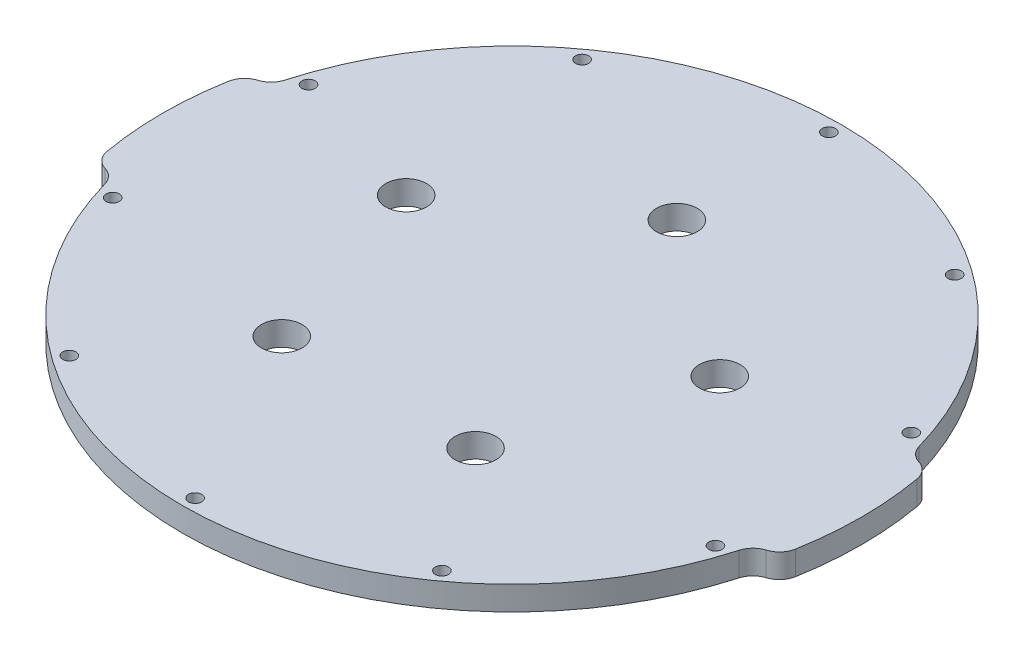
from build123d import *

# Parameters (mm, degrees)
SKETCH1_R           = 1.65
BOSS_EXTRUDE1_DEPTH = 6
FILLET1_R           = 5
SKETCH2_R           = 5.1
CUT_EXTRUDE1_DEPTH  = 121.480309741


with BuildPart() as part:
    # Sketch1 → Boss-Extrude1 (new body)
    with BuildSketch(Plane(origin=(0, 0, 0), x_dir=(1, 0, 0), z_dir=(0, 1, 0))):
        with BuildLine():
            ThreePointArc((-86.219918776, -15.202897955), (-87.55, 0), (-86.219918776, 15.202897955))
            ThreePointArc((-86.219918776, 15.202897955), (-84.101406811, 18.473379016), (-80.278914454, 19.23014285))
            ThreePointArc((-80.278914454, 19.23014285), (0, 82.55), (80.278914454, 19.23014285))
            ThreePointArc((80.278914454, 19.23014285), (84.101406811, 18.473379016), (86.219918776, 15.202897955))
            ThreePointArc((86.219918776, 15.202897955), (87.55, 0), (86.219918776, -15.202897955))
            ThreePointArc((86.219918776, -15.202897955), (84.101406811, -18.473379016), (80.278914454, -19.23014285))
            ThreePointArc((80.278914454, -19.23014285), (0, -82.55), (-80.278914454, -19.23014285))
            ThreePointArc((-80.278914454, -19.23014285), (-84.101406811, -18.473379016), (-86.219918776, -15.202897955))
        make_face()
        with Locations(Location((0, 79.35, 0), (0, 0, 270))):
            Circle(SKETCH1_R, mode=Mode.SUBTRACT)
        with Locations(Location((46.640759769, 64.195498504, 0), (0, 0, 270))):
            Circle(SKETCH1_R, mode=Mode.SUBTRACT)
        with Locations(Location((75.466334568, 24.520498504, 0), (0, 0, 270))):
            Circle(SKETCH1_R, mode=Mode.SUBTRACT)
        with Locations(Location((75.466334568, -24.520498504, 0), (0, 0, 270))):
            Circle(SKETCH1_R, mode=Mode.SUBTRACT)
        with Locations(Location((46.640759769, -64.195498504, 0), (0, 0, 270))):
            Circle(SKETCH1_R, mode=Mode.SUBTRACT)
        with Locations(Location((0, -79.35, 0), (0, 0, 270))):
            Circle(SKETCH1_R, mode=Mode.SUBTRACT)
        with Locations(Location((-46.640759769, -64.195498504, 0), (0, 0, 270))):
            Circle(SKETCH1_R, mode=Mode.SUBTRACT)
        with Locations(Location((-75.466334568, -24.520498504, 0), (0, 0, 270))):
            Circle(SKETCH1_R, mode=Mode.SUBTRACT)
        with Locations(Location((-75.466334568, 24.520498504, 0), (0, 0, 270))):
            Circle(SKETCH1_R, mode=Mode.SUBTRACT)
        with Locations(Location((-46.640759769, 64.195498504, 0), (0, 0, 270))):
            Circle(SKETCH1_R, mode=Mode.SUBTRACT)
    extrude(amount=BOSS_EXTRUDE1_DEPTH)

    # Fillet1
    fillet1_edges = [part.edges().sort_by_distance(p)[0] for p in [
        (-80.278914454, 3, -19.23014285),
        (80.278914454, 3, -19.23014285),
        (80.278914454, 3, 19.23014285),
        (-80.278914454, 3, 19.23014285),
    ]]
    fillet(fillet1_edges, radius=FILLET1_R)

    # Sketch2 → Cut-Extrude1 (cut, through all)
    with BuildSketch(Plane(origin=(0, 6, 0), x_dir=(1, 0, 0), z_dir=(0, 1, 0))):
        with Locations(Location((0, 41.275, 0), (0, 0, 270))):
            Circle(SKETCH2_R)
        with Locations(Location((39.25485771, 12.754676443, 0), (0, 0, 270))):
            Circle(SKETCH2_R)
        with Locations(Location((24.260836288, -33.392176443, 0), (0, 0, 270))):
            Circle(SKETCH2_R)
        with Locations(Location((-24.260836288, -33.392176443, 0), (0, 0, 270))):
            Circle(SKETCH2_R)
        with Locations(Location((-39.25485771, 12.754676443, 0), (0, 0, 270))):
            Circle(SKETCH2_R)
    extrude(amount=-CUT_EXTRUDE1_DEPTH, mode=Mode.SUBTRACT)


solid = part.part
